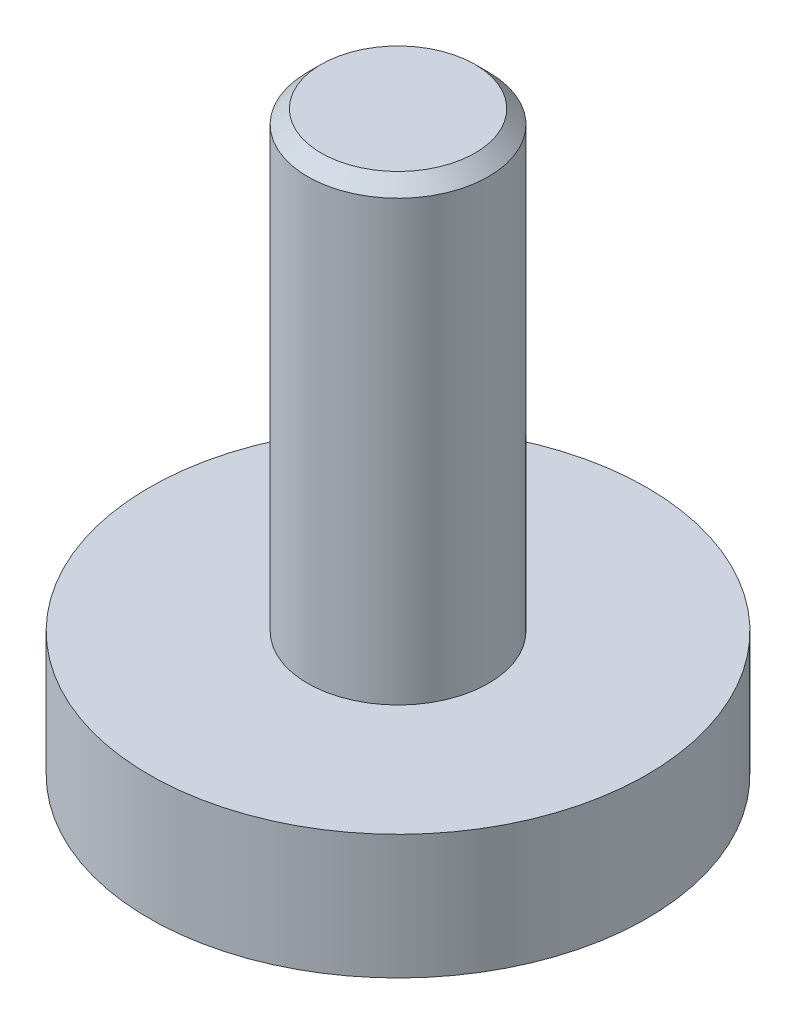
from build123d import *

# Parameters (mm, degrees)
ENL_V_MAT_EXTRU_1_DEPTH = 3.5


with BuildPart() as part:
    # Esquisse1 → R_volution1 (revolve)
    with BuildSketch(Plane.XY, mode=Mode.PRIVATE) as r_volution1_sk:
        Polygon((0, 20), (3.399093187, 20), (4, 19.399093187), (4, 0), (11, 0), (11, -5.5), (9.5, -5.5), (7.6, -3.6), (7.6, -5), (2.8875, -5), (2.5, -4.6125), (2.5, -1.5), (0, -0.056624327), align=None)
    revolve(r_volution1_sk.sketch.rotate(Axis((0, -5, 0), (0, 1, 0)), 90), axis=Axis((0, -5, 0), (0, 1, 0)))

    # Esquisse2 → Enl_v. mat.-Extru.1 (cut)
    with BuildSketch(Plane.XZ.offset(5)):
        Polygon((-2.5, 1.443375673), (-2.5, -1.443375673), (0, -2.886751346), (2.5, -1.443375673), (2.5, 1.443375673), (0, 2.886751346), align=None)
    extrude(amount=-ENL_V_MAT_EXTRU_1_DEPTH, mode=Mode.SUBTRACT)


solid = part.part
